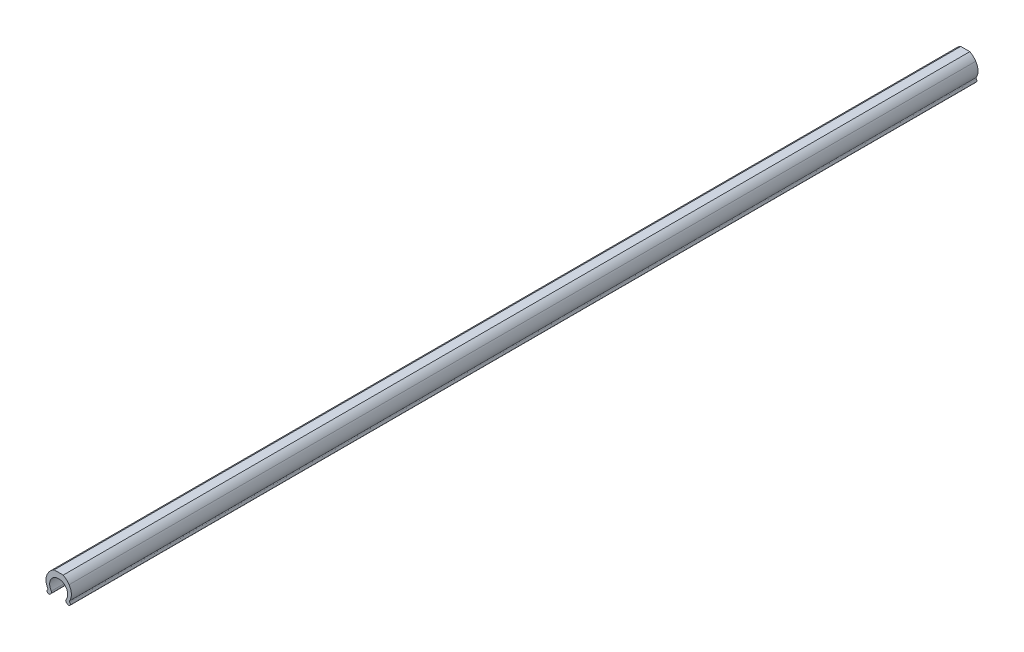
ISO-10303-21;
HEADER;
FILE_DESCRIPTION(('STEP AP214'),'2;1');
FILE_NAME('part.step','',(''),(''),'','','');
FILE_SCHEMA(('AUTOMOTIVE_DESIGN { 1 0 10303 214 1 1 1 1 }'));
ENDSEC;
DATA;
#1=APPLICATION_CONTEXT('core data for automotive mechanical design processes');
#2=APPLICATION_PROTOCOL_DEFINITION('international standard','automotive_design',2000,#1);
#3=PRODUCT_CONTEXT('',#1,'mechanical');
#4=PRODUCT('Part','Part','',(#3));
#5=PRODUCT_RELATED_PRODUCT_CATEGORY('part','',(#4));
#6=PRODUCT_DEFINITION_FORMATION('','',#4);
#7=PRODUCT_DEFINITION_CONTEXT('part definition',#1,'design');
#8=PRODUCT_DEFINITION('design','',#6,#7);
#9=PRODUCT_DEFINITION_SHAPE('','',#8);
#10=(LENGTH_UNIT() NAMED_UNIT(*) SI_UNIT(.MILLI.,.METRE.));
#11=(NAMED_UNIT(*) PLANE_ANGLE_UNIT() SI_UNIT($,.RADIAN.));
#12=(NAMED_UNIT(*) SI_UNIT($,.STERADIAN.) SOLID_ANGLE_UNIT());
#13=UNCERTAINTY_MEASURE_WITH_UNIT(LENGTH_MEASURE(1.E-05),#10,'distance_accuracy_value','');
#14=(GEOMETRIC_REPRESENTATION_CONTEXT(3) GLOBAL_UNCERTAINTY_ASSIGNED_CONTEXT((#13)) GLOBAL_UNIT_ASSIGNED_CONTEXT((#10,
#11,#12)) REPRESENTATION_CONTEXT('',''));
#15=CARTESIAN_POINT('',(0.,0.,0.));
#16=DIRECTION('',(0.,0.,1.));
#17=DIRECTION('',(1.,0.,0.));
#18=AXIS2_PLACEMENT_3D('',#15,#16,#17);
#19=CARTESIAN_POINT('',(0.,1.,500.));
#20=DIRECTION('',(0.,0.,-1.));
#21=DIRECTION('',(-1.,0.,0.));
#22=AXIS2_PLACEMENT_3D('',#19,#20,#21);
#23=CYLINDRICAL_SURFACE('',#22,7.);
#24=CARTESIAN_POINT('',(0.,1.,0.));
#25=DIRECTION('',(0.,0.,1.));
#26=DIRECTION('',(1.,0.,0.));
#27=AXIS2_PLACEMENT_3D('',#24,#25,#26);
#28=CIRCLE('',#27,7.);
#29=CARTESIAN_POINT('',(6.02657341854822,-2.56095672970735,0.));
#30=VERTEX_POINT('',#29);
#31=CARTESIAN_POINT('',(5.74419407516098,5.00052926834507,0.));
#32=VERTEX_POINT('',#31);
#33=EDGE_CURVE('E130',#30,#32,#28,.T.);
#34=ORIENTED_EDGE('',*,*,#33,.T.);
#35=DIRECTION('',(0.,0.,-1.));
#36=VECTOR('',#35,1.);
#37=CARTESIAN_POINT('',(5.74419407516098,5.00052926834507,500.));
#38=LINE('',#37,#36);
#39=CARTESIAN_POINT('',(5.74419407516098,5.00052926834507,500.));
#40=VERTEX_POINT('',#39);
#41=EDGE_CURVE('E9',#40,#32,#38,.T.);
#42=ORIENTED_EDGE('',*,*,#41,.F.);
#43=CARTESIAN_POINT('',(0.,1.,500.));
#44=DIRECTION('',(0.,0.,1.));
#45=DIRECTION('',(1.,0.,0.));
#46=AXIS2_PLACEMENT_3D('',#43,#44,#45);
#47=CIRCLE('',#46,7.);
#48=CARTESIAN_POINT('',(6.02657341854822,-2.56095672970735,500.));
#49=VERTEX_POINT('',#48);
#50=EDGE_CURVE('E175',#49,#40,#47,.T.);
#51=ORIENTED_EDGE('',*,*,#50,.F.);
#52=DIRECTION('',(0.,0.,-1.));
#53=VECTOR('',#52,1.);
#54=CARTESIAN_POINT('',(6.02657341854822,-2.56095672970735,500.));
#55=LINE('',#54,#53);
#56=EDGE_CURVE('E143',#49,#30,#55,.T.);
#57=ORIENTED_EDGE('',*,*,#56,.T.);
#58=EDGE_LOOP('',(#34,#42,#51,#57));
#59=FACE_BOUND('',#58,.T.);
#60=ADVANCED_FACE('F14',(#59),#23,.T.);
#61=CARTESIAN_POINT('',(-1.44999999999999,0.473546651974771,500.));
#62=DIRECTION('',(0.,0.,-1.));
#63=DIRECTION('',(-1.,0.,0.));
#64=AXIS2_PLACEMENT_3D('',#61,#62,#63);
#65=CYLINDRICAL_SURFACE('',#64,8.5);
#66=CARTESIAN_POINT('',(-1.44999999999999,0.473546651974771,0.));
#67=DIRECTION('',(0.,0.,1.));
#68=DIRECTION('',(1.,0.,0.));
#69=AXIS2_PLACEMENT_3D('',#66,#67,#68);
#70=CIRCLE('',#69,8.5);
#71=CARTESIAN_POINT('',(2.5,8.,0.));
#72=VERTEX_POINT('',#71);
#73=EDGE_CURVE('E126',#32,#72,#70,.T.);
#74=ORIENTED_EDGE('',*,*,#73,.T.);
#75=DIRECTION('',(0.,0.,-1.));
#76=VECTOR('',#75,1.);
#77=CARTESIAN_POINT('',(2.5,8.,500.));
#78=LINE('',#77,#76);
#79=CARTESIAN_POINT('',(2.5,8.,500.));
#80=VERTEX_POINT('',#79);
#81=EDGE_CURVE('E21',#80,#72,#78,.T.);
#82=ORIENTED_EDGE('',*,*,#81,.F.);
#83=CARTESIAN_POINT('',(-1.44999999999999,0.473546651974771,500.));
#84=DIRECTION('',(0.,0.,1.));
#85=DIRECTION('',(1.,0.,0.));
#86=AXIS2_PLACEMENT_3D('',#83,#84,#85);
#87=CIRCLE('',#86,8.5);
#88=EDGE_CURVE('E139',#40,#80,#87,.T.);
#89=ORIENTED_EDGE('',*,*,#88,.F.);
#90=ORIENTED_EDGE('',*,*,#41,.T.);
#91=EDGE_LOOP('',(#74,#82,#89,#90));
#92=FACE_BOUND('',#91,.T.);
#93=ADVANCED_FACE('F138',(#92),#65,.T.);
#94=CARTESIAN_POINT('',(2.5,8.,500.));
#95=DIRECTION('',(0.,-1.,0.));
#96=DIRECTION('',(0.,0.,-1.));
#97=AXIS2_PLACEMENT_3D('',#94,#95,#96);
#98=PLANE('',#97);
#99=DIRECTION('',(-1.,0.,0.));
#100=VECTOR('',#99,1.);
#101=CARTESIAN_POINT('',(2.5,8.,0.));
#102=LINE('',#101,#100);
#103=CARTESIAN_POINT('',(-2.5,8.,0.));
#104=VERTEX_POINT('',#103);
#105=EDGE_CURVE('E132',#72,#104,#102,.T.);
#106=ORIENTED_EDGE('',*,*,#105,.T.);
#107=DIRECTION('',(0.,0.,-1.));
#108=VECTOR('',#107,1.);
#109=CARTESIAN_POINT('',(-2.5,8.,500.));
#110=LINE('',#109,#108);
#111=CARTESIAN_POINT('',(-2.5,8.,500.));
#112=VERTEX_POINT('',#111);
#113=EDGE_CURVE('E241',#112,#104,#110,.T.);
#114=ORIENTED_EDGE('',*,*,#113,.F.);
#115=DIRECTION('',(-1.,0.,0.));
#116=VECTOR('',#115,1.);
#117=CARTESIAN_POINT('',(2.5,8.,500.));
#118=LINE('',#117,#116);
#119=EDGE_CURVE('E178',#80,#112,#118,.T.);
#120=ORIENTED_EDGE('',*,*,#119,.F.);
#121=ORIENTED_EDGE('',*,*,#81,.T.);
#122=EDGE_LOOP('',(#106,#114,#120,#121));
#123=FACE_BOUND('',#122,.T.);
#124=ADVANCED_FACE('F245',(#123),#98,.F.);
#125=CARTESIAN_POINT('',(1.45,0.473546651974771,500.));
#126=DIRECTION('',(0.,0.,-1.));
#127=DIRECTION('',(-1.,0.,0.));
#128=AXIS2_PLACEMENT_3D('',#125,#126,#127);
#129=CYLINDRICAL_SURFACE('',#128,8.5);
#130=CARTESIAN_POINT('',(1.45,0.473546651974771,0.));
#131=DIRECTION('',(0.,0.,1.));
#132=DIRECTION('',(1.,0.,0.));
#133=AXIS2_PLACEMENT_3D('',#130,#131,#132);
#134=CIRCLE('',#133,8.5);
#135=CARTESIAN_POINT('',(-5.74419407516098,5.00052926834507,0.));
#136=VERTEX_POINT('',#135);
#137=EDGE_CURVE('E147',#104,#136,#134,.T.);
#138=ORIENTED_EDGE('',*,*,#137,.T.);
#139=DIRECTION('',(0.,0.,-1.));
#140=VECTOR('',#139,1.);
#141=CARTESIAN_POINT('',(-5.74419407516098,5.00052926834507,500.));
#142=LINE('',#141,#140);
#143=CARTESIAN_POINT('',(-5.74419407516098,5.00052926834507,500.));
#144=VERTEX_POINT('',#143);
#145=EDGE_CURVE('E238',#144,#136,#142,.T.);
#146=ORIENTED_EDGE('',*,*,#145,.F.);
#147=CARTESIAN_POINT('',(1.45,0.473546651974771,500.));
#148=DIRECTION('',(0.,0.,1.));
#149=DIRECTION('',(1.,0.,0.));
#150=AXIS2_PLACEMENT_3D('',#147,#148,#149);
#151=CIRCLE('',#150,8.5);
#152=EDGE_CURVE('E180',#112,#144,#151,.T.);
#153=ORIENTED_EDGE('',*,*,#152,.F.);
#154=ORIENTED_EDGE('',*,*,#113,.T.);
#155=EDGE_LOOP('',(#138,#146,#153,#154));
#156=FACE_BOUND('',#155,.T.);
#157=ADVANCED_FACE('F253',(#156),#129,.T.);
#158=CARTESIAN_POINT('',(0.,1.,500.));
#159=DIRECTION('',(0.,0.,-1.));
#160=DIRECTION('',(-1.,0.,0.));
#161=AXIS2_PLACEMENT_3D('',#158,#159,#160);
#162=CYLINDRICAL_SURFACE('',#161,7.);
#163=CARTESIAN_POINT('',(0.,1.,0.));
#164=DIRECTION('',(0.,0.,1.));
#165=DIRECTION('',(1.,0.,0.));
#166=AXIS2_PLACEMENT_3D('',#163,#164,#165);
#167=CIRCLE('',#166,7.);
#168=CARTESIAN_POINT('',(-6.02657341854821,-2.56095672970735,0.));
#169=VERTEX_POINT('',#168);
#170=EDGE_CURVE('E149',#136,#169,#167,.T.);
#171=ORIENTED_EDGE('',*,*,#170,.T.);
#172=DIRECTION('',(0.,0.,-1.));
#173=VECTOR('',#172,1.);
#174=CARTESIAN_POINT('',(-6.02657341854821,-2.56095672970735,500.));
#175=LINE('',#174,#173);
#176=CARTESIAN_POINT('',(-6.02657341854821,-2.56095672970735,500.));
#177=VERTEX_POINT('',#176);
#178=EDGE_CURVE('E235',#177,#169,#175,.T.);
#179=ORIENTED_EDGE('',*,*,#178,.F.);
#180=CARTESIAN_POINT('',(0.,1.,500.));
#181=DIRECTION('',(0.,0.,1.));
#182=DIRECTION('',(1.,0.,0.));
#183=AXIS2_PLACEMENT_3D('',#180,#181,#182);
#184=CIRCLE('',#183,7.);
#185=EDGE_CURVE('E182',#144,#177,#184,.T.);
#186=ORIENTED_EDGE('',*,*,#185,.F.);
#187=ORIENTED_EDGE('',*,*,#145,.T.);
#188=EDGE_LOOP('',(#171,#179,#186,#187));
#189=FACE_BOUND('',#188,.T.);
#190=ADVANCED_FACE('F256',(#189),#162,.T.);
#191=CARTESIAN_POINT('',(-6.54313685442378,-2.86618159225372,500.));
#192=DIRECTION('',(0.,0.,-1.));
#193=DIRECTION('',(-1.,0.,0.));
#194=AXIS2_PLACEMENT_3D('',#191,#192,#193);
#195=CYLINDRICAL_SURFACE('',#194,0.6);
#196=CARTESIAN_POINT('',(-6.54313685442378,-2.86618159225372,0.));
#197=DIRECTION('',(0.,0.,-1.));
#198=DIRECTION('',(1.,0.,0.));
#199=AXIS2_PLACEMENT_3D('',#196,#197,#198);
#200=CIRCLE('',#199,0.6);
#201=CARTESIAN_POINT('',(-6.11887278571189,-3.29044566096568,0.));
#202=VERTEX_POINT('',#201);
#203=EDGE_CURVE('E151',#169,#202,#200,.T.);
#204=ORIENTED_EDGE('',*,*,#203,.T.);
#205=DIRECTION('',(0.,0.,-1.));
#206=VECTOR('',#205,1.);
#207=CARTESIAN_POINT('',(-6.11887278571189,-3.29044566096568,500.));
#208=LINE('',#207,#206);
#209=CARTESIAN_POINT('',(-6.11887278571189,-3.29044566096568,500.));
#210=VERTEX_POINT('',#209);
#211=EDGE_CURVE('E232',#210,#202,#208,.T.);
#212=ORIENTED_EDGE('',*,*,#211,.F.);
#213=CARTESIAN_POINT('',(-6.54313685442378,-2.86618159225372,500.));
#214=DIRECTION('',(0.,0.,-1.));
#215=DIRECTION('',(1.,0.,0.));
#216=AXIS2_PLACEMENT_3D('',#213,#214,#215);
#217=CIRCLE('',#216,0.6);
#218=EDGE_CURVE('E184',#177,#210,#217,.T.);
#219=ORIENTED_EDGE('',*,*,#218,.F.);
#220=ORIENTED_EDGE('',*,*,#178,.T.);
#221=EDGE_LOOP('',(#204,#212,#219,#220));
#222=FACE_BOUND('',#221,.T.);
#223=ADVANCED_FACE('F261',(#222),#195,.F.);
#224=CARTESIAN_POINT('',(-6.1188727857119,-3.29044566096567,500.));
#225=DIRECTION('',(0.707106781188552,-0.707106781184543,0.));
#226=DIRECTION('',(0.707106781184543,0.707106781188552,0.));
#227=AXIS2_PLACEMENT_3D('',#224,#225,#226);
#228=PLANE('',#227);
#229=DIRECTION('',(-0.707106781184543,-0.707106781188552,0.));
#230=VECTOR('',#229,1.);
#231=CARTESIAN_POINT('',(-6.1188727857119,-3.29044566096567,0.));
#232=LINE('',#231,#230);
#233=CARTESIAN_POINT('',(-6.12132034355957,-3.29289321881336,0.));
#234=VERTEX_POINT('',#233);
#235=EDGE_CURVE('E153',#202,#234,#232,.T.);
#236=ORIENTED_EDGE('',*,*,#235,.T.);
#237=DIRECTION('',(0.,0.,-1.));
#238=VECTOR('',#237,1.);
#239=CARTESIAN_POINT('',(-6.12132034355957,-3.29289321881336,500.));
#240=LINE('',#239,#238);
#241=CARTESIAN_POINT('',(-6.12132034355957,-3.29289321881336,500.));
#242=VERTEX_POINT('',#241);
#243=EDGE_CURVE('E229',#242,#234,#240,.T.);
#244=ORIENTED_EDGE('',*,*,#243,.F.);
#245=DIRECTION('',(-0.707106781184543,-0.707106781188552,0.));
#246=VECTOR('',#245,1.);
#247=CARTESIAN_POINT('',(-6.1188727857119,-3.29044566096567,500.));
#248=LINE('',#247,#246);
#249=EDGE_CURVE('E186',#210,#242,#248,.T.);
#250=ORIENTED_EDGE('',*,*,#249,.F.);
#251=ORIENTED_EDGE('',*,*,#211,.T.);
#252=EDGE_LOOP('',(#236,#244,#250,#251));
#253=FACE_BOUND('',#252,.T.);
#254=ADVANCED_FACE('F267',(#253),#228,.F.);
#255=CARTESIAN_POINT('',(-5.41421356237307,-4.,500.));
#256=DIRECTION('',(0.,0.,-1.));
#257=DIRECTION('',(-1.,0.,0.));
#258=AXIS2_PLACEMENT_3D('',#255,#256,#257);
#259=CYLINDRICAL_SURFACE('',#258,1.);
#260=CARTESIAN_POINT('',(-5.41421356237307,-4.,0.));
#261=DIRECTION('',(0.,0.,1.));
#262=DIRECTION('',(1.,0.,0.));
#263=AXIS2_PLACEMENT_3D('',#260,#261,#262);
#264=CIRCLE('',#263,1.);
#265=CARTESIAN_POINT('',(-4.70710678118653,-4.70710678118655,0.));
#266=VERTEX_POINT('',#265);
#267=EDGE_CURVE('E156',#234,#266,#264,.T.);
#268=ORIENTED_EDGE('',*,*,#267,.T.);
#269=DIRECTION('',(0.,0.,-1.));
#270=VECTOR('',#269,1.);
#271=CARTESIAN_POINT('',(-4.70710678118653,-4.70710678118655,500.));
#272=LINE('',#271,#270);
#273=CARTESIAN_POINT('',(-4.70710678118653,-4.70710678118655,500.));
#274=VERTEX_POINT('',#273);
#275=EDGE_CURVE('E226',#274,#266,#272,.T.);
#276=ORIENTED_EDGE('',*,*,#275,.F.);
#277=CARTESIAN_POINT('',(-5.41421356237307,-4.,500.));
#278=DIRECTION('',(0.,0.,1.));
#279=DIRECTION('',(1.,0.,0.));
#280=AXIS2_PLACEMENT_3D('',#277,#278,#279);
#281=CIRCLE('',#280,1.00000000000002);
#282=EDGE_CURVE('E188',#242,#274,#281,.T.);
#283=ORIENTED_EDGE('',*,*,#282,.F.);
#284=ORIENTED_EDGE('',*,*,#243,.T.);
#285=EDGE_LOOP('',(#268,#276,#283,#284));
#286=FACE_BOUND('',#285,.T.);
#287=ADVANCED_FACE('F270',(#286),#259,.T.);
#288=CARTESIAN_POINT('',(-4.18330013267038,-4.18330013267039,500.));
#289=DIRECTION('',(-0.707106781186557,0.707106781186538,0.));
#290=DIRECTION('',(-0.707106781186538,-0.707106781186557,0.));
#291=AXIS2_PLACEMENT_3D('',#288,#289,#290);
#292=PLANE('',#291);
#293=DIRECTION('',(0.707106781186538,0.707106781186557,0.));
#294=VECTOR('',#293,1.);
#295=CARTESIAN_POINT('',(-4.18330013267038,-4.18330013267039,0.));
#296=LINE('',#295,#294);
#297=CARTESIAN_POINT('',(-4.18330013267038,-4.18330013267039,0.));
#298=VERTEX_POINT('',#297);
#299=EDGE_CURVE('E158',#266,#298,#296,.T.);
#300=ORIENTED_EDGE('',*,*,#299,.T.);
#301=DIRECTION('',(0.,0.,-1.));
#302=VECTOR('',#301,1.);
#303=CARTESIAN_POINT('',(-4.18330013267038,-4.18330013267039,500.));
#304=LINE('',#303,#302);
#305=CARTESIAN_POINT('',(-4.18330013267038,-4.18330013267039,500.));
#306=VERTEX_POINT('',#305);
#307=EDGE_CURVE('E223',#306,#298,#304,.T.);
#308=ORIENTED_EDGE('',*,*,#307,.F.);
#309=DIRECTION('',(0.707106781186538,0.707106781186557,0.));
#310=VECTOR('',#309,1.);
#311=CARTESIAN_POINT('',(-4.18330013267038,-4.18330013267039,500.));
#312=LINE('',#311,#310);
#313=EDGE_CURVE('E190',#274,#306,#312,.T.);
#314=ORIENTED_EDGE('',*,*,#313,.F.);
#315=ORIENTED_EDGE('',*,*,#275,.T.);
#316=EDGE_LOOP('',(#300,#308,#314,#315));
#317=FACE_BOUND('',#316,.T.);
#318=ADVANCED_FACE('F275',(#317),#292,.F.);
#319=CARTESIAN_POINT('',(-4.89040691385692,-3.47619335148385,500.));
#320=DIRECTION('',(0.,0.,-1.));
#321=DIRECTION('',(-1.,0.,0.));
#322=AXIS2_PLACEMENT_3D('',#319,#320,#321);
#323=CYLINDRICAL_SURFACE('',#322,1.);
#324=CARTESIAN_POINT('',(-4.89040691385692,-3.47619335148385,0.));
#325=DIRECTION('',(0.,0.,1.));
#326=DIRECTION('',(1.,0.,0.));
#327=AXIS2_PLACEMENT_3D('',#324,#325,#326);
#328=CIRCLE('',#327,1.);
#329=CARTESIAN_POINT('',(-4.07533909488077,-2.8968277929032,0.));
#330=VERTEX_POINT('',#329);
#331=EDGE_CURVE('E160',#298,#330,#328,.T.);
#332=ORIENTED_EDGE('',*,*,#331,.T.);
#333=DIRECTION('',(0.,0.,-1.));
#334=VECTOR('',#333,1.);
#335=CARTESIAN_POINT('',(-4.07533909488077,-2.8968277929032,500.));
#336=LINE('',#335,#334);
#337=CARTESIAN_POINT('',(-4.07533909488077,-2.8968277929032,500.));
#338=VERTEX_POINT('',#337);
#339=EDGE_CURVE('E220',#338,#330,#336,.T.);
#340=ORIENTED_EDGE('',*,*,#339,.F.);
#341=CARTESIAN_POINT('',(-4.89040691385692,-3.47619335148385,500.));
#342=DIRECTION('',(0.,0.,1.));
#343=DIRECTION('',(1.,0.,0.));
#344=AXIS2_PLACEMENT_3D('',#341,#342,#343);
#345=CIRCLE('',#344,1.);
#346=EDGE_CURVE('E192',#306,#338,#345,.T.);
#347=ORIENTED_EDGE('',*,*,#346,.F.);
#348=ORIENTED_EDGE('',*,*,#307,.T.);
#349=EDGE_LOOP('',(#332,#340,#347,#348));
#350=FACE_BOUND('',#349,.T.);
#351=ADVANCED_FACE('F281',(#350),#323,.T.);
#352=CARTESIAN_POINT('',(0.,0.,500.));
#353=DIRECTION('',(0.,0.,-1.));
#354=DIRECTION('',(-1.,0.,0.));
#355=AXIS2_PLACEMENT_3D('',#352,#353,#354);
#356=CYLINDRICAL_SURFACE('',#355,5.);
#357=CARTESIAN_POINT('',(0.,0.,0.));
#358=DIRECTION('',(0.,0.,-1.));
#359=DIRECTION('',(1.,0.,0.));
#360=AXIS2_PLACEMENT_3D('',#357,#358,#359);
#361=CIRCLE('',#360,5.);
#362=CARTESIAN_POINT('',(4.07533909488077,-2.8968277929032,0.));
#363=VERTEX_POINT('',#362);
#364=EDGE_CURVE('E162',#330,#363,#361,.T.);
#365=ORIENTED_EDGE('',*,*,#364,.T.);
#366=DIRECTION('',(0.,0.,-1.));
#367=VECTOR('',#366,1.);
#368=CARTESIAN_POINT('',(4.07533909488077,-2.8968277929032,500.));
#369=LINE('',#368,#367);
#370=CARTESIAN_POINT('',(4.07533909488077,-2.8968277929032,500.));
#371=VERTEX_POINT('',#370);
#372=EDGE_CURVE('E217',#371,#363,#369,.T.);
#373=ORIENTED_EDGE('',*,*,#372,.F.);
#374=CARTESIAN_POINT('',(0.,0.,500.));
#375=DIRECTION('',(0.,0.,-1.));
#376=DIRECTION('',(1.,0.,0.));
#377=AXIS2_PLACEMENT_3D('',#374,#375,#376);
#378=CIRCLE('',#377,5.);
#379=EDGE_CURVE('E194',#338,#371,#378,.T.);
#380=ORIENTED_EDGE('',*,*,#379,.F.);
#381=ORIENTED_EDGE('',*,*,#339,.T.);
#382=EDGE_LOOP('',(#365,#373,#380,#381));
#383=FACE_BOUND('',#382,.T.);
#384=ADVANCED_FACE('F285',(#383),#356,.F.);
#385=CARTESIAN_POINT('',(4.89040691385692,-3.47619335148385,500.));
#386=DIRECTION('',(0.,0.,-1.));
#387=DIRECTION('',(-1.,0.,0.));
#388=AXIS2_PLACEMENT_3D('',#385,#386,#387);
#389=CYLINDRICAL_SURFACE('',#388,1.);
#390=CARTESIAN_POINT('',(4.89040691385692,-3.47619335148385,0.));
#391=DIRECTION('',(0.,0.,1.));
#392=DIRECTION('',(1.,0.,0.));
#393=AXIS2_PLACEMENT_3D('',#390,#391,#392);
#394=CIRCLE('',#393,1.);
#395=CARTESIAN_POINT('',(4.18330013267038,-4.1833001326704,0.));
#396=VERTEX_POINT('',#395);
#397=EDGE_CURVE('E164',#363,#396,#394,.T.);
#398=ORIENTED_EDGE('',*,*,#397,.T.);
#399=DIRECTION('',(0.,0.,-1.));
#400=VECTOR('',#399,1.);
#401=CARTESIAN_POINT('',(4.18330013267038,-4.1833001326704,500.));
#402=LINE('',#401,#400);
#403=CARTESIAN_POINT('',(4.18330013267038,-4.1833001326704,500.));
#404=VERTEX_POINT('',#403);
#405=EDGE_CURVE('E214',#404,#396,#402,.T.);
#406=ORIENTED_EDGE('',*,*,#405,.F.);
#407=CARTESIAN_POINT('',(4.89040691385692,-3.47619335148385,500.));
#408=DIRECTION('',(0.,0.,1.));
#409=DIRECTION('',(1.,0.,0.));
#410=AXIS2_PLACEMENT_3D('',#407,#408,#409);
#411=CIRCLE('',#410,1.);
#412=EDGE_CURVE('E196',#371,#404,#411,.T.);
#413=ORIENTED_EDGE('',*,*,#412,.F.);
#414=ORIENTED_EDGE('',*,*,#372,.T.);
#415=EDGE_LOOP('',(#398,#406,#413,#414));
#416=FACE_BOUND('',#415,.T.);
#417=ADVANCED_FACE('F290',(#416),#389,.T.);
#418=CARTESIAN_POINT('',(4.18330013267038,-4.18330013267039,500.));
#419=DIRECTION('',(0.707106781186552,0.707106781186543,0.));
#420=DIRECTION('',(-0.707106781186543,0.707106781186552,0.));
#421=AXIS2_PLACEMENT_3D('',#418,#419,#420);
#422=PLANE('',#421);
#423=DIRECTION('',(0.707106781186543,-0.707106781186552,0.));
#424=VECTOR('',#423,1.);
#425=CARTESIAN_POINT('',(4.18330013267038,-4.18330013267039,0.));
#426=LINE('',#425,#424);
#427=CARTESIAN_POINT('',(4.70710678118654,-4.70710678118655,0.));
#428=VERTEX_POINT('',#427);
#429=EDGE_CURVE('E166',#396,#428,#426,.T.);
#430=ORIENTED_EDGE('',*,*,#429,.T.);
#431=DIRECTION('',(0.,0.,-1.));
#432=VECTOR('',#431,1.);
#433=CARTESIAN_POINT('',(4.70710678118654,-4.70710678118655,500.));
#434=LINE('',#433,#432);
#435=CARTESIAN_POINT('',(4.70710678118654,-4.70710678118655,500.));
#436=VERTEX_POINT('',#435);
#437=EDGE_CURVE('E211',#436,#428,#434,.T.);
#438=ORIENTED_EDGE('',*,*,#437,.F.);
#439=DIRECTION('',(0.707106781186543,-0.707106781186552,0.));
#440=VECTOR('',#439,1.);
#441=CARTESIAN_POINT('',(4.18330013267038,-4.18330013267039,500.));
#442=LINE('',#441,#440);
#443=EDGE_CURVE('E198',#404,#436,#442,.T.);
#444=ORIENTED_EDGE('',*,*,#443,.F.);
#445=ORIENTED_EDGE('',*,*,#405,.T.);
#446=EDGE_LOOP('',(#430,#438,#444,#445));
#447=FACE_BOUND('',#446,.T.);
#448=ADVANCED_FACE('F296',(#447),#422,.F.);
#449=CARTESIAN_POINT('',(5.41421356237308,-4.,500.));
#450=DIRECTION('',(0.,0.,-1.));
#451=DIRECTION('',(-1.,0.,0.));
#452=AXIS2_PLACEMENT_3D('',#449,#450,#451);
#453=CYLINDRICAL_SURFACE('',#452,1.00000000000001);
#454=CARTESIAN_POINT('',(5.41421356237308,-4.,0.));
#455=DIRECTION('',(0.,0.,1.));
#456=DIRECTION('',(1.,0.,0.));
#457=AXIS2_PLACEMENT_3D('',#454,#455,#456);
#458=CIRCLE('',#457,1.00000000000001);
#459=CARTESIAN_POINT('',(6.12132034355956,-3.29289321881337,0.));
#460=VERTEX_POINT('',#459);
#461=EDGE_CURVE('E169',#428,#460,#458,.T.);
#462=ORIENTED_EDGE('',*,*,#461,.T.);
#463=DIRECTION('',(0.,0.,-1.));
#464=VECTOR('',#463,1.);
#465=CARTESIAN_POINT('',(6.12132034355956,-3.29289321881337,500.));
#466=LINE('',#465,#464);
#467=CARTESIAN_POINT('',(6.12132034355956,-3.29289321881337,500.));
#468=VERTEX_POINT('',#467);
#469=EDGE_CURVE('E208',#468,#460,#466,.T.);
#470=ORIENTED_EDGE('',*,*,#469,.F.);
#471=CARTESIAN_POINT('',(5.41421356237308,-4.,500.));
#472=DIRECTION('',(0.,0.,1.));
#473=DIRECTION('',(1.,0.,0.));
#474=AXIS2_PLACEMENT_3D('',#471,#472,#473);
#475=CIRCLE('',#474,1.);
#476=EDGE_CURVE('E200',#436,#468,#475,.T.);
#477=ORIENTED_EDGE('',*,*,#476,.F.);
#478=ORIENTED_EDGE('',*,*,#437,.T.);
#479=EDGE_LOOP('',(#462,#470,#477,#478));
#480=FACE_BOUND('',#479,.T.);
#481=ADVANCED_FACE('F299',(#480),#453,.T.);
#482=CARTESIAN_POINT('',(6.1188727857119,-3.29044566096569,500.));
#483=DIRECTION('',(-0.707106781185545,-0.70710678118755,0.));
#484=DIRECTION('',(0.70710678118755,-0.707106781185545,0.));
#485=AXIS2_PLACEMENT_3D('',#482,#483,#484);
#486=PLANE('',#485);
#487=DIRECTION('',(-0.70710678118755,0.707106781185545,0.));
#488=VECTOR('',#487,1.);
#489=CARTESIAN_POINT('',(6.1188727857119,-3.29044566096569,0.));
#490=LINE('',#489,#488);
#491=CARTESIAN_POINT('',(6.1188727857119,-3.29044566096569,0.));
#492=VERTEX_POINT('',#491);
#493=EDGE_CURVE('E171',#460,#492,#490,.T.);
#494=ORIENTED_EDGE('',*,*,#493,.T.);
#495=DIRECTION('',(0.,0.,-1.));
#496=VECTOR('',#495,1.);
#497=CARTESIAN_POINT('',(6.1188727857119,-3.29044566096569,500.));
#498=LINE('',#497,#496);
#499=CARTESIAN_POINT('',(6.1188727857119,-3.29044566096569,500.));
#500=VERTEX_POINT('',#499);
#501=EDGE_CURVE('E205',#500,#492,#498,.T.);
#502=ORIENTED_EDGE('',*,*,#501,.F.);
#503=DIRECTION('',(-0.70710678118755,0.707106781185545,0.));
#504=VECTOR('',#503,1.);
#505=CARTESIAN_POINT('',(6.1188727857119,-3.29044566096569,500.));
#506=LINE('',#505,#504);
#507=EDGE_CURVE('E33',#468,#500,#506,.T.);
#508=ORIENTED_EDGE('',*,*,#507,.F.);
#509=ORIENTED_EDGE('',*,*,#469,.T.);
#510=EDGE_LOOP('',(#494,#502,#508,#509));
#511=FACE_BOUND('',#510,.T.);
#512=ADVANCED_FACE('F302',(#511),#486,.F.);
#513=CARTESIAN_POINT('',(6.54313685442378,-2.86618159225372,500.));
#514=DIRECTION('',(0.,0.,-1.));
#515=DIRECTION('',(-1.,0.,0.));
#516=AXIS2_PLACEMENT_3D('',#513,#514,#515);
#517=CYLINDRICAL_SURFACE('',#516,0.600000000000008);
#518=CARTESIAN_POINT('',(6.54313685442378,-2.86618159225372,0.));
#519=DIRECTION('',(0.,0.,-1.));
#520=DIRECTION('',(1.,0.,0.));
#521=AXIS2_PLACEMENT_3D('',#518,#519,#520);
#522=CIRCLE('',#521,0.600000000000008);
#523=EDGE_CURVE('E173',#492,#30,#522,.T.);
#524=ORIENTED_EDGE('',*,*,#523,.T.);
#525=ORIENTED_EDGE('',*,*,#56,.F.);
#526=CARTESIAN_POINT('',(6.54313685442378,-2.86618159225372,500.));
#527=DIRECTION('',(0.,0.,-1.));
#528=DIRECTION('',(1.,0.,0.));
#529=AXIS2_PLACEMENT_3D('',#526,#527,#528);
#530=CIRCLE('',#529,0.600000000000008);
#531=EDGE_CURVE('E28',#500,#49,#530,.T.);
#532=ORIENTED_EDGE('',*,*,#531,.F.);
#533=ORIENTED_EDGE('',*,*,#501,.T.);
#534=EDGE_LOOP('',(#524,#525,#532,#533));
#535=FACE_BOUND('',#534,.T.);
#536=ADVANCED_FACE('F304',(#535),#517,.F.);
#537=CARTESIAN_POINT('',(0.,1.,500.));
#538=DIRECTION('',(0.,0.,1.));
#539=DIRECTION('',(1.,0.,0.));
#540=AXIS2_PLACEMENT_3D('',#537,#538,#539);
#541=PLANE('',#540);
#542=ORIENTED_EDGE('',*,*,#50,.T.);
#543=ORIENTED_EDGE('',*,*,#88,.T.);
#544=ORIENTED_EDGE('',*,*,#119,.T.);
#545=ORIENTED_EDGE('',*,*,#152,.T.);
#546=ORIENTED_EDGE('',*,*,#185,.T.);
#547=ORIENTED_EDGE('',*,*,#218,.T.);
#548=ORIENTED_EDGE('',*,*,#249,.T.);
#549=ORIENTED_EDGE('',*,*,#282,.T.);
#550=ORIENTED_EDGE('',*,*,#313,.T.);
#551=ORIENTED_EDGE('',*,*,#346,.T.);
#552=ORIENTED_EDGE('',*,*,#379,.T.);
#553=ORIENTED_EDGE('',*,*,#412,.T.);
#554=ORIENTED_EDGE('',*,*,#443,.T.);
#555=ORIENTED_EDGE('',*,*,#476,.T.);
#556=ORIENTED_EDGE('',*,*,#507,.T.);
#557=ORIENTED_EDGE('',*,*,#531,.T.);
#558=EDGE_LOOP('',(#542,#543,#544,#545,#546,#547,#548,#549,#550,#551,#552,#553,#554,#555,#556,#557));
#559=FACE_BOUND('',#558,.T.);
#560=ADVANCED_FACE('F248',(#559),#541,.T.);
#561=CARTESIAN_POINT('',(0.,1.,0.));
#562=DIRECTION('',(0.,0.,1.));
#563=DIRECTION('',(1.,0.,0.));
#564=AXIS2_PLACEMENT_3D('',#561,#562,#563);
#565=PLANE('',#564);
#566=ORIENTED_EDGE('',*,*,#33,.F.);
#567=ORIENTED_EDGE('',*,*,#523,.F.);
#568=ORIENTED_EDGE('',*,*,#493,.F.);
#569=ORIENTED_EDGE('',*,*,#461,.F.);
#570=ORIENTED_EDGE('',*,*,#429,.F.);
#571=ORIENTED_EDGE('',*,*,#397,.F.);
#572=ORIENTED_EDGE('',*,*,#364,.F.);
#573=ORIENTED_EDGE('',*,*,#331,.F.);
#574=ORIENTED_EDGE('',*,*,#299,.F.);
#575=ORIENTED_EDGE('',*,*,#267,.F.);
#576=ORIENTED_EDGE('',*,*,#235,.F.);
#577=ORIENTED_EDGE('',*,*,#203,.F.);
#578=ORIENTED_EDGE('',*,*,#170,.F.);
#579=ORIENTED_EDGE('',*,*,#137,.F.);
#580=ORIENTED_EDGE('',*,*,#105,.F.);
#581=ORIENTED_EDGE('',*,*,#73,.F.);
#582=EDGE_LOOP('',(#566,#567,#568,#569,#570,#571,#572,#573,#574,#575,#576,#577,#578,#579,#580,#581));
#583=FACE_BOUND('',#582,.T.);
#584=ADVANCED_FACE('F127',(#583),#565,.F.);
#585=CLOSED_SHELL('',(#60,#93,#124,#157,#190,#223,#254,#287,#318,#351,#384,#417,#448,#481,#512,
#536,#560,#584));
#586=MANIFOLD_SOLID_BREP('B1',#585);
#587=ADVANCED_BREP_SHAPE_REPRESENTATION('',(#18,#586),#14);
#588=SHAPE_DEFINITION_REPRESENTATION(#9,#587);
ENDSEC;
END-ISO-10303-21;
